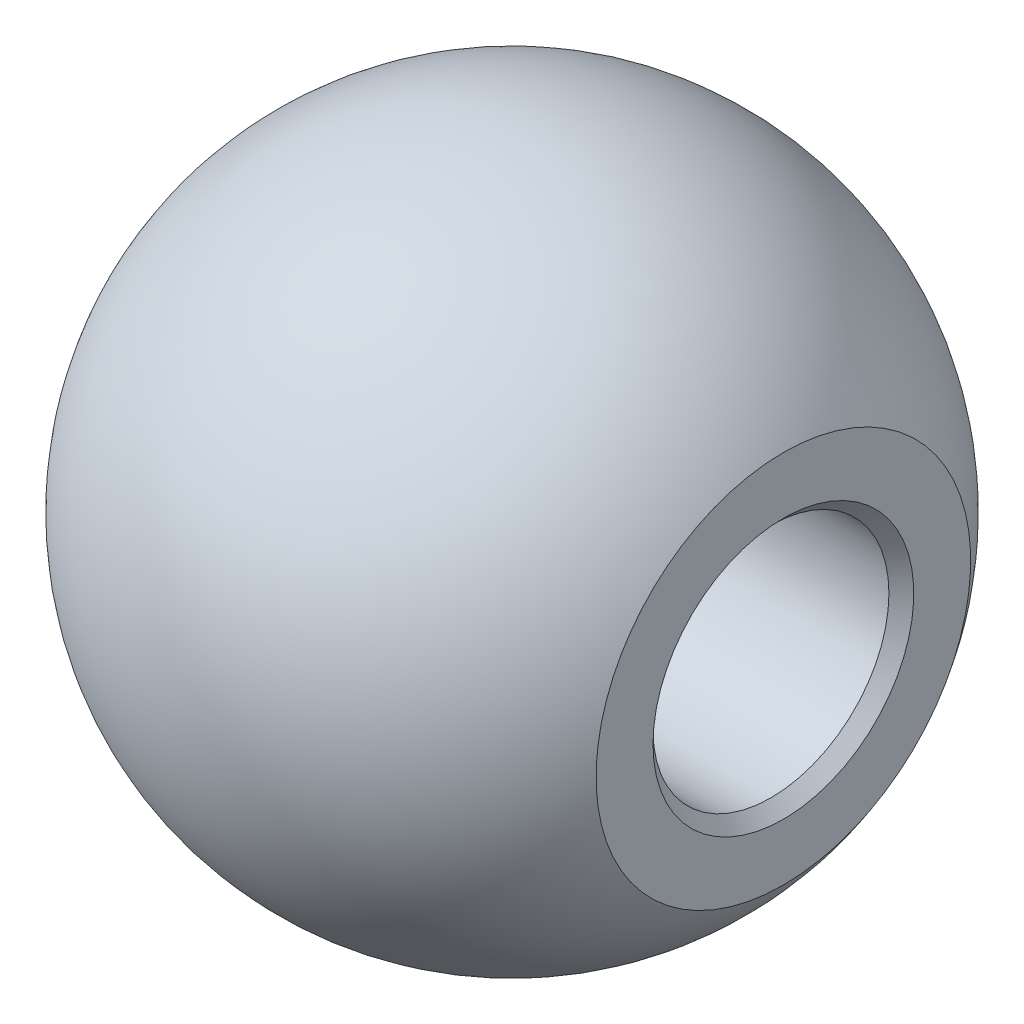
from build123d import *

# Parameters (mm, degrees)
CHAMFER1_SIZE = 0.254


with BuildPart() as part:
    # Sketch1 → Revolve1 (revolve)
    with BuildSketch(Plane.XY, mode=Mode.PRIVATE) as revolve1_sk:
        with BuildLine():
            Line((0, 2.413), (5.5499, 2.413))
            Line((5.5499, 2.413), (5.5499, 3.830939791))
            ThreePointArc((5.5499, 3.830939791), (3.13390978, 5.971272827), (0, 6.7437))
            Line((0, 6.7437), (0, 2.413))
        make_face()
    revolve(revolve1_sk.sketch.rotate(Axis((0, 0, 0), (1, 0, 0)), 90), axis=Axis((0, 0, 0), (1, 0, 0)))

    # Chamfer1
    chamfer1_edges = [part.edges().sort_by_distance(p)[0] for p in [
        (5.5499, 0, -2.413),
    ]]
    chamfer(chamfer1_edges, length=CHAMFER1_SIZE)

    # Mirror1: part across plane


with BuildPart() as part_1:
    add(part.part)
    add(part.part.mirror(Plane(origin=(0, 0, 0), x_dir=(0, 0, 1), z_dir=(1, 0, 0))))


solid = part_1.part
